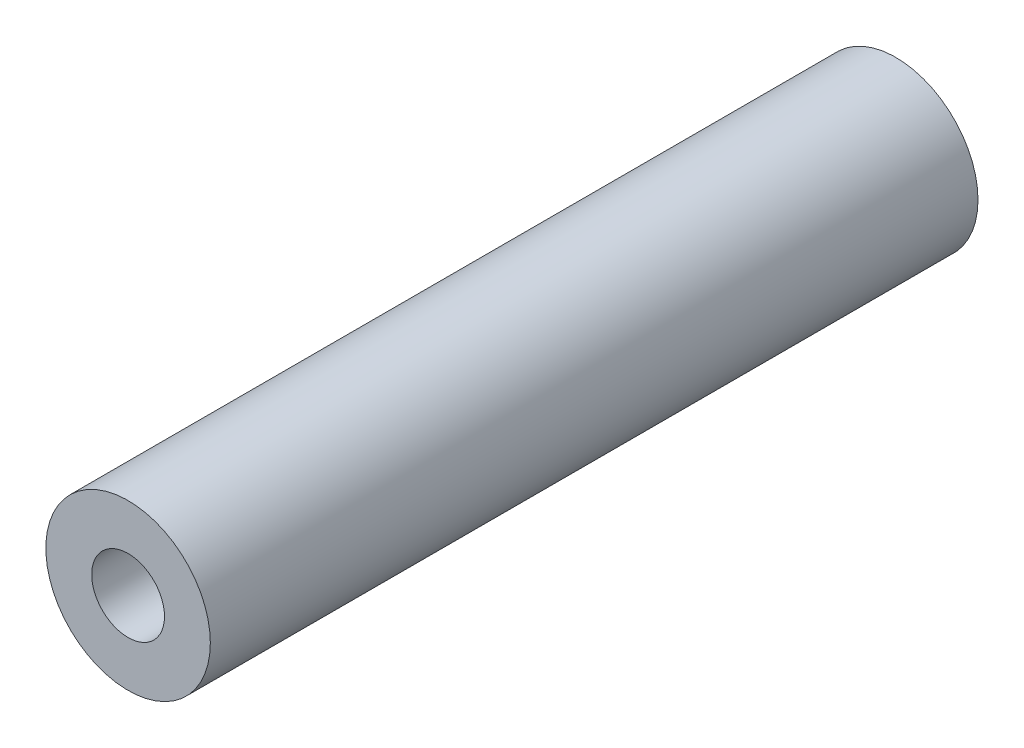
ISO-10303-21;
HEADER;
FILE_DESCRIPTION(('STEP AP214'),'2;1');
FILE_NAME('part.step','',(''),(''),'','','');
FILE_SCHEMA(('AUTOMOTIVE_DESIGN { 1 0 10303 214 1 1 1 1 }'));
ENDSEC;
DATA;
#1=APPLICATION_CONTEXT('core data for automotive mechanical design processes');
#2=APPLICATION_PROTOCOL_DEFINITION('international standard','automotive_design',2000,#1);
#3=PRODUCT_CONTEXT('',#1,'mechanical');
#4=PRODUCT('Part','Part','',(#3));
#5=PRODUCT_RELATED_PRODUCT_CATEGORY('part','',(#4));
#6=PRODUCT_DEFINITION_FORMATION('','',#4);
#7=PRODUCT_DEFINITION_CONTEXT('part definition',#1,'design');
#8=PRODUCT_DEFINITION('design','',#6,#7);
#9=PRODUCT_DEFINITION_SHAPE('','',#8);
#10=(LENGTH_UNIT() NAMED_UNIT(*) SI_UNIT(.MILLI.,.METRE.));
#11=(NAMED_UNIT(*) PLANE_ANGLE_UNIT() SI_UNIT($,.RADIAN.));
#12=(NAMED_UNIT(*) SI_UNIT($,.STERADIAN.) SOLID_ANGLE_UNIT());
#13=UNCERTAINTY_MEASURE_WITH_UNIT(LENGTH_MEASURE(1.E-05),#10,'distance_accuracy_value','');
#14=(GEOMETRIC_REPRESENTATION_CONTEXT(3) GLOBAL_UNCERTAINTY_ASSIGNED_CONTEXT((#13)) GLOBAL_UNIT_ASSIGNED_CONTEXT((#10,
#11,#12)) REPRESENTATION_CONTEXT('',''));
#15=CARTESIAN_POINT('',(0.,0.,0.));
#16=DIRECTION('',(0.,0.,1.));
#17=DIRECTION('',(1.,0.,0.));
#18=AXIS2_PLACEMENT_3D('',#15,#16,#17);
#19=CARTESIAN_POINT('',(0.,0.,22.225));
#20=DIRECTION('',(0.,0.,1.));
#21=DIRECTION('',(1.,0.,0.));
#22=AXIS2_PLACEMENT_3D('',#19,#20,#21);
#23=PLANE('',#22);
#24=CARTESIAN_POINT('',(0.,0.,22.225));
#25=DIRECTION('',(0.,0.,1.));
#26=DIRECTION('',(1.,0.,0.));
#27=AXIS2_PLACEMENT_3D('',#24,#25,#26);
#28=CIRCLE('',#27,4.7625);
#29=CARTESIAN_POINT('',(4.7625,0.,22.225));
#30=VERTEX_POINT('',#29);
#31=EDGE_CURVE('E10',#30,#30,#28,.T.);
#32=ORIENTED_EDGE('',*,*,#31,.T.);
#33=EDGE_LOOP('',(#32));
#34=FACE_BOUND('',#33,.T.);
#35=CARTESIAN_POINT('',(0.,0.,22.225));
#36=DIRECTION('',(0.,0.,1.));
#37=DIRECTION('',(1.,0.,0.));
#38=AXIS2_PLACEMENT_3D('',#35,#36,#37);
#39=CIRCLE('',#38,2.1082);
#40=CARTESIAN_POINT('',(2.1082,0.,22.225));
#41=VERTEX_POINT('',#40);
#42=EDGE_CURVE('E42',#41,#41,#39,.T.);
#43=ORIENTED_EDGE('',*,*,#42,.F.);
#44=EDGE_LOOP('',(#43));
#45=FACE_BOUND('',#44,.T.);
#46=ADVANCED_FACE('F31',(#34,#45),#23,.T.);
#47=CARTESIAN_POINT('',(0.,0.,-22.225));
#48=DIRECTION('',(0.,0.,1.));
#49=DIRECTION('',(1.,0.,0.));
#50=AXIS2_PLACEMENT_3D('',#47,#48,#49);
#51=PLANE('',#50);
#52=CARTESIAN_POINT('',(0.,0.,-22.225));
#53=DIRECTION('',(0.,0.,1.));
#54=DIRECTION('',(1.,0.,0.));
#55=AXIS2_PLACEMENT_3D('',#52,#53,#54);
#56=CIRCLE('',#55,4.7625);
#57=CARTESIAN_POINT('',(4.7625,0.,-22.225));
#58=VERTEX_POINT('',#57);
#59=EDGE_CURVE('E35',#58,#58,#56,.T.);
#60=ORIENTED_EDGE('',*,*,#59,.F.);
#61=EDGE_LOOP('',(#60));
#62=FACE_BOUND('',#61,.T.);
#63=CARTESIAN_POINT('',(0.,0.,-22.225));
#64=DIRECTION('',(0.,0.,1.));
#65=DIRECTION('',(1.,0.,0.));
#66=AXIS2_PLACEMENT_3D('',#63,#64,#65);
#67=CIRCLE('',#66,2.1082);
#68=CARTESIAN_POINT('',(2.1082,0.,-22.225));
#69=VERTEX_POINT('',#68);
#70=EDGE_CURVE('E44',#69,#69,#67,.T.);
#71=ORIENTED_EDGE('',*,*,#70,.T.);
#72=EDGE_LOOP('',(#71));
#73=FACE_BOUND('',#72,.T.);
#74=ADVANCED_FACE('F54',(#62,#73),#51,.F.);
#75=CARTESIAN_POINT('',(0.,0.,22.225));
#76=DIRECTION('',(0.,0.,-1.));
#77=DIRECTION('',(-1.,0.,0.));
#78=AXIS2_PLACEMENT_3D('',#75,#76,#77);
#79=CYLINDRICAL_SURFACE('',#78,4.7625);
#80=ORIENTED_EDGE('',*,*,#31,.F.);
#81=EDGE_LOOP('',(#80));
#82=FACE_BOUND('',#81,.T.);
#83=ORIENTED_EDGE('',*,*,#59,.T.);
#84=EDGE_LOOP('',(#83));
#85=FACE_BOUND('',#84,.T.);
#86=ADVANCED_FACE('F33',(#82,#85),#79,.T.);
#87=CARTESIAN_POINT('',(0.,0.,22.225));
#88=DIRECTION('',(0.,0.,-1.));
#89=DIRECTION('',(-1.,0.,0.));
#90=AXIS2_PLACEMENT_3D('',#87,#88,#89);
#91=CYLINDRICAL_SURFACE('',#90,2.1082);
#92=ORIENTED_EDGE('',*,*,#42,.T.);
#93=EDGE_LOOP('',(#92));
#94=FACE_BOUND('',#93,.T.);
#95=ORIENTED_EDGE('',*,*,#70,.F.);
#96=EDGE_LOOP('',(#95));
#97=FACE_BOUND('',#96,.T.);
#98=ADVANCED_FACE('F50',(#94,#97),#91,.F.);
#99=CLOSED_SHELL('',(#46,#74,#86,#98));
#100=MANIFOLD_SOLID_BREP('B2',#99);
#101=ADVANCED_BREP_SHAPE_REPRESENTATION('',(#18,#100),#14);
#102=SHAPE_DEFINITION_REPRESENTATION(#9,#101);
ENDSEC;
END-ISO-10303-21;
